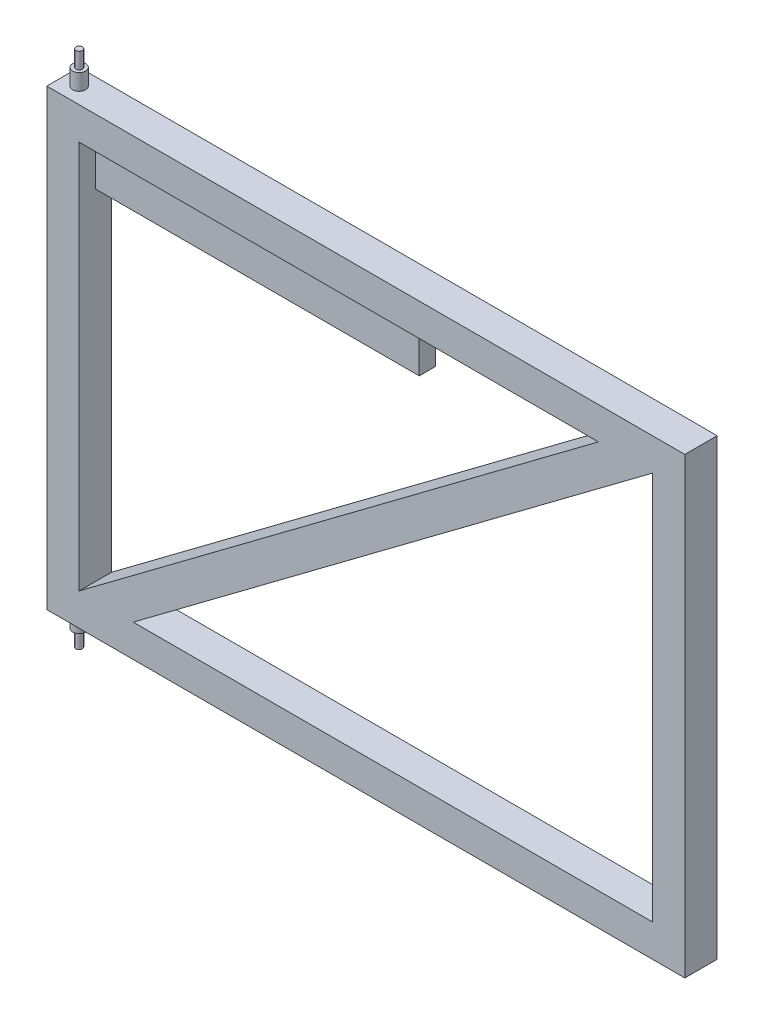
from build123d import *

# Parameters (mm, degrees)
ESQUISSE1_W          = 985
ESQUISSE1_H          = 700
BASE_EXTRUSION_DEPTH = 25
ESQUISSE2_R          = 5
BOSS_EXTRU_1_DEPTH   = 400
ESQUISSE4_R          = 10
BOSS_EXTRU_3_DEPTH   = 375
ESQUISSE3_W          = 500
ESQUISSE3_H          = 75
BOSS_EXTRU_2_DEPTH   = 25


with BuildPart() as part:
    # Esquisse1 → Base-Extrusion (new, symmetric)
    with BuildSketch(Plane.XY):
        Rectangle(ESQUISSE1_W, ESQUISSE1_H)
        Polygon((-442.5, 300), (359.062465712, 300), (-442.5, -300), align=None, mode=Mode.SUBTRACT)
        Polygon((442.5, 300), (442.5, -300), (-359.062465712, -300), align=None, mode=Mode.SUBTRACT)
    extrude(amount=BASE_EXTRUSION_DEPTH, both=True)

    # Esquisse2 → Boss.-Extru.1 (add, symmetric)
    with BuildSketch(Plane(origin=(0, 0, 0), x_dir=(1, 0, 0), z_dir=(0, 1, 0))):
        with Locations(Location((-467.5, 0, 0), (0, 0, 90))):
            Circle(ESQUISSE2_R)
    extrude(amount=BOSS_EXTRU_1_DEPTH, both=True)

    # Esquisse4 → Boss.-Extru.3 (add, symmetric)
    with BuildSketch(Plane(origin=(0, 0, 0), x_dir=(1, 0, 0), z_dir=(0, 1, 0))):
        with Locations(Location((-467.5, 0, 0), (0, 0, 270))):
            Circle(ESQUISSE4_R)
    extrude(amount=BOSS_EXTRU_3_DEPTH, both=True)

    # Esquisse3 → Boss.-Extru.2 (add)
    with BuildSketch(Plane.XY):
        with Locations((-192.5, 262.5)):
            Rectangle(ESQUISSE3_W, ESQUISSE3_H)
    extrude(amount=-BOSS_EXTRU_2_DEPTH)


solid = part.part
